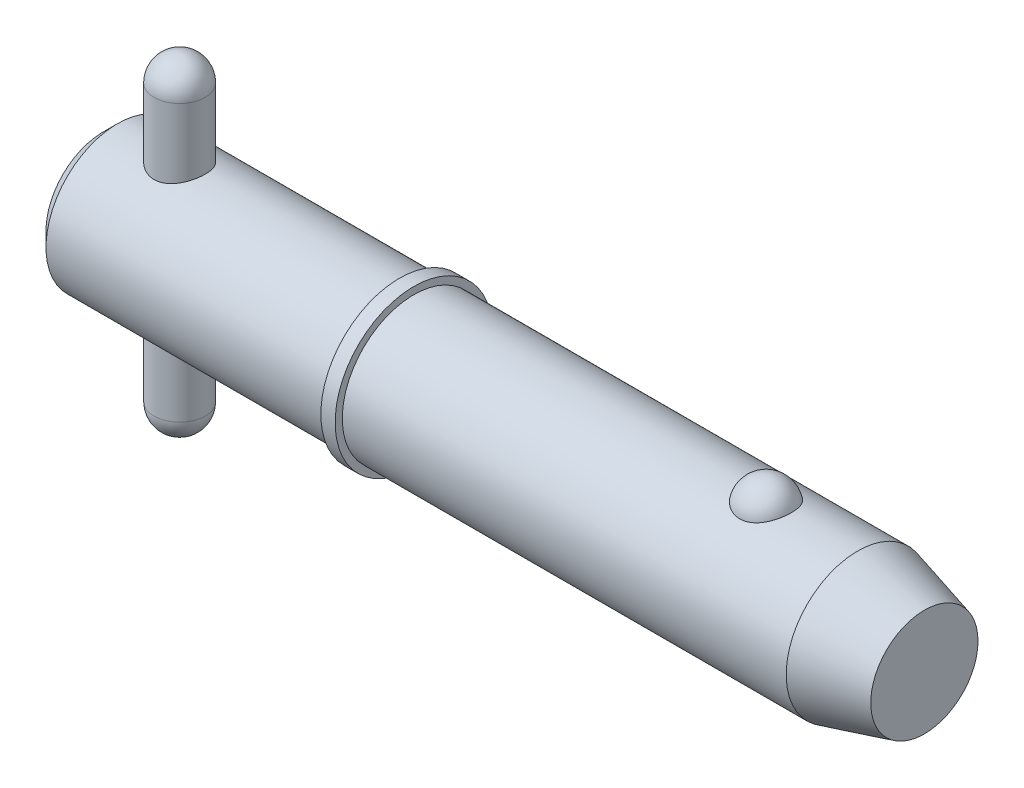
ISO-10303-21;
HEADER;
FILE_DESCRIPTION(('STEP AP214'),'2;1');
FILE_NAME('part.step','',(''),(''),'','','');
FILE_SCHEMA(('AUTOMOTIVE_DESIGN { 1 0 10303 214 1 1 1 1 }'));
ENDSEC;
DATA;
#1=APPLICATION_CONTEXT('core data for automotive mechanical design processes');
#2=APPLICATION_PROTOCOL_DEFINITION('international standard','automotive_design',2000,#1);
#3=PRODUCT_CONTEXT('',#1,'mechanical');
#4=PRODUCT('Part','Part','',(#3));
#5=PRODUCT_RELATED_PRODUCT_CATEGORY('part','',(#4));
#6=PRODUCT_DEFINITION_FORMATION('','',#4);
#7=PRODUCT_DEFINITION_CONTEXT('part definition',#1,'design');
#8=PRODUCT_DEFINITION('design','',#6,#7);
#9=PRODUCT_DEFINITION_SHAPE('','',#8);
#10=(LENGTH_UNIT() NAMED_UNIT(*) SI_UNIT(.MILLI.,.METRE.));
#11=(NAMED_UNIT(*) PLANE_ANGLE_UNIT() SI_UNIT($,.RADIAN.));
#12=(NAMED_UNIT(*) SI_UNIT($,.STERADIAN.) SOLID_ANGLE_UNIT());
#13=UNCERTAINTY_MEASURE_WITH_UNIT(LENGTH_MEASURE(1.E-05),#10,'distance_accuracy_value','');
#14=(GEOMETRIC_REPRESENTATION_CONTEXT(3) GLOBAL_UNCERTAINTY_ASSIGNED_CONTEXT((#13)) GLOBAL_UNIT_ASSIGNED_CONTEXT((#10,
#11,#12)) REPRESENTATION_CONTEXT('',''));
#15=CARTESIAN_POINT('',(0.,0.,0.));
#16=DIRECTION('',(0.,0.,1.));
#17=DIRECTION('',(1.,0.,0.));
#18=AXIS2_PLACEMENT_3D('',#15,#16,#17);
#19=CARTESIAN_POINT('',(5.94,12.7,0.));
#20=DIRECTION('',(0.,-1.,0.));
#21=DIRECTION('',(0.,0.,-1.));
#22=AXIS2_PLACEMENT_3D('',#19,#20,#21);
#23=CYLINDRICAL_SURFACE('',#22,1.98);
#24=CARTESIAN_POINT('',(5.94,-10.72,0.));
#25=DIRECTION('',(0.,-1.,0.));
#26=DIRECTION('',(0.,0.,-1.));
#27=AXIS2_PLACEMENT_3D('',#24,#25,#26);
#28=CIRCLE('',#27,1.98);
#29=CARTESIAN_POINT('',(5.94,-10.72,-1.98));
#30=VERTEX_POINT('',#29);
#31=EDGE_CURVE('P0_E10',#30,#30,#28,.F.);
#32=ORIENTED_EDGE('',*,*,#31,.T.);
#33=EDGE_LOOP('',(#32));
#34=FACE_BOUND('',#33,.T.);
#35=CARTESIAN_POINT('',(5.94,10.72,0.));
#36=DIRECTION('',(0.,-1.,0.));
#37=DIRECTION('',(0.,0.,-1.));
#38=AXIS2_PLACEMENT_3D('',#35,#36,#37);
#39=CIRCLE('',#38,1.98);
#40=CARTESIAN_POINT('',(5.94,10.72,-1.98));
#41=VERTEX_POINT('',#40);
#42=EDGE_CURVE('P0_E21',#41,#41,#39,.T.);
#43=ORIENTED_EDGE('',*,*,#42,.T.);
#44=EDGE_LOOP('',(#43));
#45=FACE_BOUND('',#44,.T.);
#46=ADVANCED_FACE('P0_F14',(#34,#45),#23,.T.);
#47=CARTESIAN_POINT('',(5.94,-10.72,0.));
#48=DIRECTION('',(0.,0.,1.));
#49=DIRECTION('',(1.,0.,0.));
#50=AXIS2_PLACEMENT_3D('',#47,#48,#49);
#51=SPHERICAL_SURFACE('',#50,1.98);
#52=CARTESIAN_POINT('',(5.94,-10.72,0.));
#53=DIRECTION('',(0.,-1.,0.));
#54=DIRECTION('',(0.,0.,-1.));
#55=AXIS2_PLACEMENT_3D('',#52,#53,#54);
#56=SPHERICAL_SURFACE('',#55,1.98);
#57=ORIENTED_EDGE('',*,*,#31,.F.);
#58=EDGE_LOOP('',(#57));
#59=FACE_BOUND('',#58,.T.);
#60=ADVANCED_FACE('P0_F29',(#59),#56,.T.);
#61=CARTESIAN_POINT('',(5.94,10.72,0.));
#62=DIRECTION('',(0.,0.,1.));
#63=DIRECTION('',(1.,0.,0.));
#64=AXIS2_PLACEMENT_3D('',#61,#62,#63);
#65=SPHERICAL_SURFACE('',#64,1.98);
#66=CARTESIAN_POINT('',(5.94,10.72,0.));
#67=DIRECTION('',(0.,-1.,0.));
#68=DIRECTION('',(0.,0.,-1.));
#69=AXIS2_PLACEMENT_3D('',#66,#67,#68);
#70=SPHERICAL_SURFACE('',#69,1.98);
#71=ORIENTED_EDGE('',*,*,#42,.F.);
#72=EDGE_LOOP('',(#71));
#73=FACE_BOUND('',#72,.T.);
#74=ADVANCED_FACE('P0_F16',(#73),#70,.T.);
#75=CLOSED_SHELL('',(#46,#60,#74));
#76=MANIFOLD_SOLID_BREP('P0_B1',#75);
#77=CARTESIAN_POINT('',(0.,0.,0.));
#78=DIRECTION('',(1.,0.,0.));
#79=DIRECTION('',(0.,0.,-1.));
#80=AXIS2_PLACEMENT_3D('',#77,#78,#79);
#81=CYLINDRICAL_SURFACE('',#80,5.555);
#82=CARTESIAN_POINT('',(58.6171144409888,0.,0.));
#83=DIRECTION('',(1.,0.,0.));
#84=DIRECTION('',(0.,0.,-1.));
#85=AXIS2_PLACEMENT_3D('',#82,#83,#84);
#86=CIRCLE('',#85,5.555);
#87=CARTESIAN_POINT('',(58.6171144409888,0.,-5.555));
#88=VERTEX_POINT('',#87);
#89=EDGE_CURVE('P1_E81',#88,#88,#86,.T.);
#90=ORIENTED_EDGE('',*,*,#89,.F.);
#91=EDGE_LOOP('',(#90));
#92=FACE_BOUND('',#91,.T.);
#93=CARTESIAN_POINT('',(24.13,0.,0.));
#94=DIRECTION('',(1.,0.,0.));
#95=DIRECTION('',(0.,0.,-1.));
#96=AXIS2_PLACEMENT_3D('',#93,#94,#95);
#97=CIRCLE('',#96,5.555);
#98=CARTESIAN_POINT('',(24.13,0.,-5.555));
#99=VERTEX_POINT('',#98);
#100=EDGE_CURVE('P1_E85',#99,#99,#97,.T.);
#101=ORIENTED_EDGE('',*,*,#100,.T.);
#102=EDGE_LOOP('',(#101));
#103=FACE_BOUND('',#102,.T.);
#104=CARTESIAN_POINT('',(51.4986264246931,5.16741224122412,2.03859650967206));
#105=CARTESIAN_POINT('',(51.3929492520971,5.16740893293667,2.03859990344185));
#106=CARTESIAN_POINT('',(51.28729894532,5.17079470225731,2.03008306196));
#107=CARTESIAN_POINT('',(51.0791419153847,5.18392795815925,1.99630721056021));
#108=CARTESIAN_POINT('',(50.9766344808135,5.19367399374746,1.97105201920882));
#109=CARTESIAN_POINT('',(50.7777710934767,5.21839168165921,1.90463997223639));
#110=CARTESIAN_POINT('',(50.6814064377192,5.23335573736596,1.86350622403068));
#111=CARTESIAN_POINT('',(50.4970804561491,5.26688076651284,1.76652592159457));
#112=CARTESIAN_POINT('',(50.4091207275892,5.28544242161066,1.71067657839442));
#113=CARTESIAN_POINT('',(50.2412654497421,5.32479845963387,1.58399959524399));
#114=CARTESIAN_POINT('',(50.1616656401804,5.34564089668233,1.51279545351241));
#115=CARTESIAN_POINT('',(50.0151290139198,5.38697258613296,1.35828584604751));
#116=CARTESIAN_POINT('',(49.948194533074,5.40746177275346,1.27497815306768));
#117=CARTESIAN_POINT('',(49.8256103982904,5.44694508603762,1.09440293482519));
#118=CARTESIAN_POINT('',(49.7705989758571,5.46583143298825,0.996677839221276));
#119=CARTESIAN_POINT('',(49.6769376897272,5.49908030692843,0.792961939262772));
#120=CARTESIAN_POINT('',(49.6382894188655,5.513442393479,0.686970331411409));
#121=CARTESIAN_POINT('',(49.5776807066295,5.53635851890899,0.46801974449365));
#122=CARTESIAN_POINT('',(49.5559725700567,5.54482455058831,0.3549815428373));
#123=CARTESIAN_POINT('',(49.5306362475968,5.55473324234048,0.126595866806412));
#124=CARTESIAN_POINT('',(49.5270077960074,5.55617600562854,0.0112484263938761));
#125=CARTESIAN_POINT('',(49.5378817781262,5.55189984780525,-0.218011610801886));
#126=CARTESIAN_POINT('',(49.5523151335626,5.54620821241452,-0.331928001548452));
#127=CARTESIAN_POINT('',(49.598903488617,5.52828920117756,-0.555544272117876));
#128=CARTESIAN_POINT('',(49.6310588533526,5.5160616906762,-0.665244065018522));
#129=CARTESIAN_POINT('',(49.7124883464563,5.48630779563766,-0.877469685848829));
#130=CARTESIAN_POINT('',(49.7617816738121,5.4687754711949,-0.979987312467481));
#131=CARTESIAN_POINT('',(49.8764785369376,5.43024700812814,-1.1748697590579));
#132=CARTESIAN_POINT('',(49.9418831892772,5.4092506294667,-1.26723387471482));
#133=CARTESIAN_POINT('',(50.0875712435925,5.36600927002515,-1.4394013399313));
#134=CARTESIAN_POINT('',(50.1678859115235,5.34376173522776,-1.51917763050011));
#135=CARTESIAN_POINT('',(50.3414520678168,5.30057971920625,-1.66360338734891));
#136=CARTESIAN_POINT('',(50.434702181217,5.27964509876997,-1.72825445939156));
#137=CARTESIAN_POINT('',(50.6293939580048,5.24205250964,-1.83909478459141));
#138=CARTESIAN_POINT('',(50.7305900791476,5.22530519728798,-1.88568407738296));
#139=CARTESIAN_POINT('',(50.9401552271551,5.1975091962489,-1.96100802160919));
#140=CARTESIAN_POINT('',(51.0485215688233,5.1864583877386,-1.98974931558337));
#141=CARTESIAN_POINT('',(51.2634989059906,5.17184410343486,-2.02742262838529));
#142=CARTESIAN_POINT('',(51.369925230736,5.1679328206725,-2.03727608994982));
#143=CARTESIAN_POINT('',(51.5829925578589,5.16698995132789,-2.03966777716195));
#144=CARTESIAN_POINT('',(51.6896335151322,5.16995704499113,-2.03220932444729));
#145=CARTESIAN_POINT('',(51.8967730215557,5.18222383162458,-2.00071170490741));
#146=CARTESIAN_POINT('',(51.9973599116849,5.19133213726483,-1.97717337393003));
#147=CARTESIAN_POINT('',(52.1930141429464,5.21467637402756,-1.91475248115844));
#148=CARTESIAN_POINT('',(52.2880810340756,5.22891272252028,-1.8758686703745));
#149=CARTESIAN_POINT('',(52.4723711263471,5.26137066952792,-1.7828271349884));
#150=CARTESIAN_POINT('',(52.5614190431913,5.27967329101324,-1.72835124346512));
#151=CARTESIAN_POINT('',(52.7292880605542,5.3181741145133,-1.60597483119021));
#152=CARTESIAN_POINT('',(52.8081068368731,5.33837274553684,-1.53807126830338));
#153=CARTESIAN_POINT('',(52.9575156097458,5.37968287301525,-1.38688970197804));
#154=CARTESIAN_POINT('',(53.0275058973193,5.40079011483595,-1.30301744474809));
#155=CARTESIAN_POINT('',(53.1530125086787,5.44074401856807,-1.12458170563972));
#156=CARTESIAN_POINT('',(53.2085262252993,5.4595902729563,-1.03001630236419));
#157=CARTESIAN_POINT('',(53.3055507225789,5.49369849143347,-0.829439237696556));
#158=CARTESIAN_POINT('',(53.3465483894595,5.50882422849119,-0.723155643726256));
#159=CARTESIAN_POINT('',(53.4111250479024,5.53310911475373,-0.50477271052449));
#160=CARTESIAN_POINT('',(53.4347036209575,5.54226812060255,-0.392673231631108));
#161=CARTESIAN_POINT('',(53.464013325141,5.55370358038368,-0.165459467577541));
#162=CARTESIAN_POINT('',(53.4696884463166,5.55595843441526,-0.0503368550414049));
#163=CARTESIAN_POINT('',(53.462916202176,5.55329317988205,0.179288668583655));
#164=CARTESIAN_POINT('',(53.4504690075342,5.54837313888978,0.293791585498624));
#165=CARTESIAN_POINT('',(53.4077798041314,5.53189037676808,0.518526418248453));
#166=CARTESIAN_POINT('',(53.377598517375,5.5203503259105,0.62877154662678));
#167=CARTESIAN_POINT('',(53.3000962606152,5.49182453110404,0.84231815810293));
#168=CARTESIAN_POINT('',(53.2527743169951,5.47483847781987,0.945619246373));
#169=CARTESIAN_POINT('',(53.1417204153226,5.43710633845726,1.14281571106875));
#170=CARTESIAN_POINT('',(53.077921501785,5.41634501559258,1.23667048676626));
#171=CARTESIAN_POINT('',(52.9353577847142,5.37334572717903,1.41185243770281));
#172=CARTESIAN_POINT('',(52.8565932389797,5.35110778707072,1.49317982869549));
#173=CARTESIAN_POINT('',(52.6864234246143,5.30779474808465,1.64049162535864));
#174=CARTESIAN_POINT('',(52.5951002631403,5.28671324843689,1.70656877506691));
#175=CARTESIAN_POINT('',(52.4017390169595,5.24804852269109,1.82201372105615));
#176=CARTESIAN_POINT('',(52.2997005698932,5.23046541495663,1.87138095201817));
#177=CARTESIAN_POINT('',(52.0836187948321,5.20042692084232,1.95335298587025));
#178=CARTESIAN_POINT('',(51.9692602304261,5.18820192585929,1.98521734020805));
#179=CARTESIAN_POINT('',(51.7361307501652,5.17169804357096,2.02783294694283));
#180=CARTESIAN_POINT('',(51.6173616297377,5.16741595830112,2.03859269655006));
#181=CARTESIAN_POINT('',(51.4986264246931,5.16741224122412,2.03859650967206));
#182=B_SPLINE_CURVE_WITH_KNOTS('',3,(#104,#105,#106,#107,#108,#109,#110,#111,#112,#113,#114,
#115,#116,#117,#118,#119,#120,#121,#122,#123,#124,#125,#126,#127,#128,#129,#130,#131,#132,#133,
#134,#135,#136,#137,#138,#139,#140,#141,#142,#143,#144,#145,#146,#147,#148,#149,#150,#151,#152,
#153,#154,#155,#156,#157,#158,#159,#160,#161,#162,#163,#164,#165,#166,#167,#168,#169,#170,#171,
#172,#173,#174,#175,#176,#177,#178,#179,#180,#181),.UNSPECIFIED.,.T.,.F.,(4,2,2,2,2,2,2,2,2,2,2,
2,2,2,2,2,2,2,2,2,2,2,2,2,2,2,2,2,2,2,2,2,2,2,2,2,2,2,4),(0.,0.316595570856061,
0.633118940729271,0.949183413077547,1.26530783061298,1.59030762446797,1.9153672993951,
2.25495824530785,2.59458224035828,2.93917283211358,3.28375835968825,3.62703002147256,
3.97030875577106,4.31397329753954,4.657661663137,5.00207904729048,5.34645984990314,
5.68270547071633,6.01882587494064,6.33808403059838,6.65728093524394,6.96696376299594,
7.27667180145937,7.59321535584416,7.90983070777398,8.24210387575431,8.57443684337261,
8.91755896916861,9.2606893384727,9.60489211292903,9.94909164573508,10.2921194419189,
10.6351667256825,10.9796305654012,11.3240884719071,11.6663928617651,12.0087088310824,
12.3645679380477,12.7202837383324),.UNSPECIFIED.);
#183=CARTESIAN_POINT('',(51.4986264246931,5.16741224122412,2.03859650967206));
#184=VERTEX_POINT('',#183);
#185=EDGE_CURVE('P1_E35',#184,#184,#182,.T.);
#186=ORIENTED_EDGE('',*,*,#185,.T.);
#187=EDGE_LOOP('',(#186));
#188=FACE_BOUND('',#187,.T.);
#189=ADVANCED_FACE('P1_F13',(#92,#103,#188),#81,.T.);
#190=CARTESIAN_POINT('',(0.,0.,0.));
#191=DIRECTION('',(-1.,0.,0.));
#192=DIRECTION('',(0.,0.,1.));
#193=AXIS2_PLACEMENT_3D('',#190,#191,#192);
#194=PLANE('',#193);
#195=CARTESIAN_POINT('',(0.,0.,0.));
#196=DIRECTION('',(1.,0.,0.));
#197=DIRECTION('',(0.,0.,-1.));
#198=AXIS2_PLACEMENT_3D('',#195,#196,#197);
#199=CIRCLE('',#198,4.444);
#200=CARTESIAN_POINT('',(0.,0.,-4.444));
#201=VERTEX_POINT('',#200);
#202=EDGE_CURVE('P1_E9',#201,#201,#199,.T.);
#203=ORIENTED_EDGE('',*,*,#202,.F.);
#204=EDGE_LOOP('',(#203));
#205=FACE_BOUND('',#204,.T.);
#206=ADVANCED_FACE('P1_F15',(#205),#194,.T.);
#207=CARTESIAN_POINT('',(1.111,0.,0.));
#208=DIRECTION('',(1.,0.,0.));
#209=DIRECTION('',(0.,0.,-1.));
#210=AXIS2_PLACEMENT_3D('',#207,#208,#209);
#211=CONICAL_SURFACE('',#210,5.555,0.78539816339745);
#212=ORIENTED_EDGE('',*,*,#202,.T.);
#213=EDGE_LOOP('',(#212));
#214=FACE_BOUND('',#213,.T.);
#215=CARTESIAN_POINT('',(1.111,0.,0.));
#216=DIRECTION('',(1.,0.,0.));
#217=DIRECTION('',(0.,0.,-1.));
#218=AXIS2_PLACEMENT_3D('',#215,#216,#217);
#219=CIRCLE('',#218,5.555);
#220=CARTESIAN_POINT('',(1.111,0.,-5.555));
#221=VERTEX_POINT('',#220);
#222=EDGE_CURVE('P1_E26',#221,#221,#219,.T.);
#223=ORIENTED_EDGE('',*,*,#222,.F.);
#224=EDGE_LOOP('',(#223));
#225=FACE_BOUND('',#224,.T.);
#226=ADVANCED_FACE('P1_F77',(#214,#225),#211,.T.);
#227=CARTESIAN_POINT('',(0.,0.,0.));
#228=DIRECTION('',(1.,0.,0.));
#229=DIRECTION('',(0.,0.,-1.));
#230=AXIS2_PLACEMENT_3D('',#227,#228,#229);
#231=CYLINDRICAL_SURFACE('',#230,5.555);
#232=CARTESIAN_POINT('',(5.94,-5.19014691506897,1.98));
#233=CARTESIAN_POINT('',(5.83264687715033,-5.19014494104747,1.98000226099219));
#234=CARTESIAN_POINT('',(5.7253094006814,-5.19351395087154,1.97123988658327));
#235=CARTESIAN_POINT('',(5.51384517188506,-5.20654291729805,1.93656219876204));
#236=CARTESIAN_POINT('',(5.40971858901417,-5.21620320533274,1.91064598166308));
#237=CARTESIAN_POINT('',(5.20778082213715,-5.24058443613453,1.84271148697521));
#238=CARTESIAN_POINT('',(5.10995634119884,-5.25529427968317,1.80072850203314));
#239=CARTESIAN_POINT('',(4.92270352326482,-5.28810012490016,1.70197537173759));
#240=CARTESIAN_POINT('',(4.83327743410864,-5.3061970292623,1.64520128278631));
#241=CARTESIAN_POINT('',(4.66135184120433,-5.34464714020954,1.51575187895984));
#242=CARTESIAN_POINT('',(4.57928277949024,-5.36506222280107,1.44252311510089));
#243=CARTESIAN_POINT('',(4.42829115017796,-5.40532920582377,1.28342047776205));
#244=CARTESIAN_POINT('',(4.35937105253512,-5.42518099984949,1.19754423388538));
#245=CARTESIAN_POINT('',(4.23461605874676,-5.46281133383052,1.01237205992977));
#246=CARTESIAN_POINT('',(4.17924129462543,-5.48050875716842,0.912748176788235));
#247=CARTESIAN_POINT('',(4.0862117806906,-5.51109938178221,0.70485824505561));
#248=CARTESIAN_POINT('',(4.0485515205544,-5.52399407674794,0.596594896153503));
#249=CARTESIAN_POINT('',(3.99350662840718,-5.54308759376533,0.379019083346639));
#250=CARTESIAN_POINT('',(3.97538263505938,-5.54952987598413,0.269915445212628));
#251=CARTESIAN_POINT('',(3.95756405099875,-5.55586205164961,0.0500378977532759));
#252=CARTESIAN_POINT('',(3.95786404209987,-5.55575387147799,-0.060735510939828));
#253=CARTESIAN_POINT('',(3.97643665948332,-5.54915684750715,-0.275539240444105));
#254=CARTESIAN_POINT('',(3.99390415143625,-5.54295384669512,-0.379649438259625));
#255=CARTESIAN_POINT('',(4.0449721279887,-5.52523170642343,-0.583350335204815));
#256=CARTESIAN_POINT('',(4.07857373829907,-5.51371219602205,-0.682940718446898));
#257=CARTESIAN_POINT('',(4.16137312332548,-5.4863099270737,-0.876423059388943));
#258=CARTESIAN_POINT('',(4.2107826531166,-5.47036834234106,-0.970215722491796));
#259=CARTESIAN_POINT('',(4.32361427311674,-5.43575653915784,-1.1484017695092));
#260=CARTESIAN_POINT('',(4.38704062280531,-5.41708549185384,-1.23279228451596));
#261=CARTESIAN_POINT('',(4.53006791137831,-5.37778429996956,-1.39454579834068));
#262=CARTESIAN_POINT('',(4.61035105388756,-5.35710277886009,-1.4712940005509));
#263=CARTESIAN_POINT('',(4.78279835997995,-5.31692766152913,-1.6104545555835));
#264=CARTESIAN_POINT('',(4.874964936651,-5.29743430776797,-1.67286398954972));
#265=CARTESIAN_POINT('',(5.07076688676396,-5.26153775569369,-1.78259698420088));
#266=CARTESIAN_POINT('',(5.17458163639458,-5.24519780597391,-1.8296227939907));
#267=CARTESIAN_POINT('',(5.38938990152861,-5.21818744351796,-1.90530278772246));
#268=CARTESIAN_POINT('',(5.50037985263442,-5.20751423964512,-1.93396601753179));
#269=CARTESIAN_POINT('',(5.72036376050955,-5.19369176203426,-1.97077654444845));
#270=CARTESIAN_POINT('',(5.82917370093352,-5.19018851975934,-1.97989015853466));
#271=CARTESIAN_POINT('',(6.04680100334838,-5.19010609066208,-1.98010779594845));
#272=CARTESIAN_POINT('',(6.15561835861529,-5.19352540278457,-1.97121572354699));
#273=CARTESIAN_POINT('',(6.36548036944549,-5.20654623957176,-1.93654727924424));
#274=CARTESIAN_POINT('',(6.46666051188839,-5.21588705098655,-1.91148218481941));
#275=CARTESIAN_POINT('',(6.66334537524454,-5.23939939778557,-1.84605494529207));
#276=CARTESIAN_POINT('',(6.75884899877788,-5.25357186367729,-1.8056898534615));
#277=CARTESIAN_POINT('',(6.94517989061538,-5.28576258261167,-1.70921153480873));
#278=CARTESIAN_POINT('',(7.03572661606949,-5.30389804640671,-1.65259670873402));
#279=CARTESIAN_POINT('',(7.20638087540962,-5.34176077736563,-1.52577523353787));
#280=CARTESIAN_POINT('',(7.28648490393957,-5.36148857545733,-1.45556404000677));
#281=CARTESIAN_POINT('',(7.43864697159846,-5.40165494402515,-1.2988614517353));
#282=CARTESIAN_POINT('',(7.50999887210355,-5.42207106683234,-1.21167640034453));
#283=CARTESIAN_POINT('',(7.63712639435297,-5.46023601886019,-1.026066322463));
#284=CARTESIAN_POINT('',(7.69290228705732,-5.47798489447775,-0.927641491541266));
#285=CARTESIAN_POINT('',(7.78684673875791,-5.50876590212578,-0.722633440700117));
#286=CARTESIAN_POINT('',(7.82510508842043,-5.52182201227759,-0.616095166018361));
#287=CARTESIAN_POINT('',(7.88297051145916,-5.54184206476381,-0.397530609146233));
#288=CARTESIAN_POINT('',(7.90258540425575,-5.5488085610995,-0.285506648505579));
#289=CARTESIAN_POINT('',(7.9218262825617,-5.55564472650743,-0.065566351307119));
#290=CARTESIAN_POINT('',(7.92245987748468,-5.55587212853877,0.0422515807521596));
#291=CARTESIAN_POINT('',(7.90626329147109,-5.55011340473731,0.256387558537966));
#292=CARTESIAN_POINT('',(7.88943488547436,-5.54412791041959,0.362705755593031));
#293=CARTESIAN_POINT('',(7.83948457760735,-5.52676548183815,0.568649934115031));
#294=CARTESIAN_POINT('',(7.8067003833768,-5.51550046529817,0.668367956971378));
#295=CARTESIAN_POINT('',(7.72609369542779,-5.48874437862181,0.860911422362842));
#296=CARTESIAN_POINT('',(7.67826838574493,-5.47325251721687,0.953735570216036));
#297=CARTESIAN_POINT('',(7.56675024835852,-5.43884382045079,1.13391068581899));
#298=CARTESIAN_POINT('',(7.50249968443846,-5.41981485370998,1.22089468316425));
#299=CARTESIAN_POINT('',(7.36086495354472,-5.38069275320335,1.38316665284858));
#300=CARTESIAN_POINT('',(7.28347630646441,-5.36059925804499,1.45845061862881));
#301=CARTESIAN_POINT('',(7.11347587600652,-5.32048380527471,1.59876646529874));
#302=CARTESIAN_POINT('',(7.02032386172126,-5.30050854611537,1.66315951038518));
#303=CARTESIAN_POINT('',(6.82388804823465,-5.26398994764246,1.77536801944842));
#304=CARTESIAN_POINT('',(6.7206049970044,-5.24744635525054,1.82318470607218));
#305=CARTESIAN_POINT('',(6.50639706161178,-5.21987969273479,1.90068230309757));
#306=CARTESIAN_POINT('',(6.3954529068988,-5.20887116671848,1.93031547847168));
#307=CARTESIAN_POINT('',(6.16966522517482,-5.19400760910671,1.96996824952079));
#308=CARTESIAN_POINT('',(6.05482366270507,-5.19014902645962,1.97999758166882));
#309=CARTESIAN_POINT('',(5.94,-5.19014691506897,1.98));
#310=B_SPLINE_CURVE_WITH_KNOTS('',3,(#232,#233,#234,#235,#236,#237,#238,#239,#240,#241,#242,
#243,#244,#245,#246,#247,#248,#249,#250,#251,#252,#253,#254,#255,#256,#257,#258,#259,#260,#261,
#262,#263,#264,#265,#266,#267,#268,#269,#270,#271,#272,#273,#274,#275,#276,#277,#278,#279,#280,
#281,#282,#283,#284,#285,#286,#287,#288,#289,#290,#291,#292,#293,#294,#295,#296,#297,#298,#299,
#300,#301,#302,#303,#304,#305,#306,#307,#308,#309),.UNSPECIFIED.,.T.,.F.,(4,2,2,2,2,2,2,2,2,2,2,
2,2,2,2,2,2,2,2,2,2,2,2,2,2,2,2,2,2,2,2,2,2,2,2,2,2,2,4),(0.,0.321632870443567,
0.643282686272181,0.964229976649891,1.28526292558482,1.61937087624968,1.9535415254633,
2.29784481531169,2.64204093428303,2.97269632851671,3.30325448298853,3.61901541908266,
3.93479838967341,4.25500220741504,4.57530346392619,4.91268648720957,5.25013812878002,
5.59378026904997,5.93725299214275,6.26331481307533,6.58930593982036,6.90185604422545,
7.21446637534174,7.53801472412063,7.86167140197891,8.20353561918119,8.54539388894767,
8.88547970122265,9.22542281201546,9.54728637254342,9.86911722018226,10.1844146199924,
10.4997710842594,10.827730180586,11.1558013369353,11.499115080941,11.8424034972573,
12.1865892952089,12.5306041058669),.UNSPECIFIED.);
#311=CARTESIAN_POINT('',(5.94,-5.19014691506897,1.98));
#312=VERTEX_POINT('',#311);
#313=EDGE_CURVE('P1_E17',#312,#312,#310,.T.);
#314=ORIENTED_EDGE('',*,*,#313,.F.);
#315=EDGE_LOOP('',(#314));
#316=FACE_BOUND('',#315,.T.);
#317=CARTESIAN_POINT('',(5.94,5.19014691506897,1.98));
#318=CARTESIAN_POINT('',(6.04735312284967,5.19014494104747,1.98000226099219));
#319=CARTESIAN_POINT('',(6.1546905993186,5.19351395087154,1.97123988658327));
#320=CARTESIAN_POINT('',(6.36615482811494,5.20654291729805,1.93656219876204));
#321=CARTESIAN_POINT('',(6.47028141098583,5.21620320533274,1.91064598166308));
#322=CARTESIAN_POINT('',(6.67221917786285,5.24058443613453,1.84271148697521));
#323=CARTESIAN_POINT('',(6.77004365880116,5.25529427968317,1.80072850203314));
#324=CARTESIAN_POINT('',(6.95729647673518,5.28810012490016,1.70197537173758));
#325=CARTESIAN_POINT('',(7.04672256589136,5.3061970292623,1.64520128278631));
#326=CARTESIAN_POINT('',(7.21864815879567,5.34464714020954,1.51575187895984));
#327=CARTESIAN_POINT('',(7.30071722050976,5.36506222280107,1.44252311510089));
#328=CARTESIAN_POINT('',(7.45170884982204,5.40532920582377,1.28342047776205));
#329=CARTESIAN_POINT('',(7.52062894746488,5.42518099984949,1.19754423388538));
#330=CARTESIAN_POINT('',(7.64538394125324,5.46281133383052,1.01237205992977));
#331=CARTESIAN_POINT('',(7.70075870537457,5.48050875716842,0.912748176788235));
#332=CARTESIAN_POINT('',(7.7937882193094,5.51109938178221,0.704858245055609));
#333=CARTESIAN_POINT('',(7.8314484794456,5.52399407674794,0.596594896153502));
#334=CARTESIAN_POINT('',(7.88649337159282,5.54308759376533,0.379019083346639));
#335=CARTESIAN_POINT('',(7.90461736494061,5.54952987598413,0.269915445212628));
#336=CARTESIAN_POINT('',(7.92243594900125,5.55586205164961,0.0500378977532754));
#337=CARTESIAN_POINT('',(7.92213595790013,5.55575387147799,-0.0607355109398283));
#338=CARTESIAN_POINT('',(7.90356334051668,5.54915684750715,-0.275539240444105));
#339=CARTESIAN_POINT('',(7.88609584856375,5.54295384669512,-0.379649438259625));
#340=CARTESIAN_POINT('',(7.8350278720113,5.52523170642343,-0.583350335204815));
#341=CARTESIAN_POINT('',(7.80142626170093,5.51371219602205,-0.682940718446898));
#342=CARTESIAN_POINT('',(7.71862687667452,5.4863099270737,-0.876423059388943));
#343=CARTESIAN_POINT('',(7.6692173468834,5.47036834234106,-0.970215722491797));
#344=CARTESIAN_POINT('',(7.55638572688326,5.43575653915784,-1.1484017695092));
#345=CARTESIAN_POINT('',(7.49295937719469,5.41708549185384,-1.23279228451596));
#346=CARTESIAN_POINT('',(7.34993208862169,5.37778429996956,-1.39454579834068));
#347=CARTESIAN_POINT('',(7.26964894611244,5.35710277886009,-1.4712940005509));
#348=CARTESIAN_POINT('',(7.09720164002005,5.31692766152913,-1.6104545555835));
#349=CARTESIAN_POINT('',(7.00503506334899,5.29743430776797,-1.67286398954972));
#350=CARTESIAN_POINT('',(6.80923311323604,5.26153775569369,-1.78259698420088));
#351=CARTESIAN_POINT('',(6.70541836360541,5.24519780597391,-1.8296227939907));
#352=CARTESIAN_POINT('',(6.49061009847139,5.21818744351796,-1.90530278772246));
#353=CARTESIAN_POINT('',(6.37962014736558,5.20751423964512,-1.93396601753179));
#354=CARTESIAN_POINT('',(6.15963623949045,5.19369176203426,-1.97077654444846));
#355=CARTESIAN_POINT('',(6.05082629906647,5.19018851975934,-1.97989015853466));
#356=CARTESIAN_POINT('',(5.83319899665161,5.19010609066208,-1.98010779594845));
#357=CARTESIAN_POINT('',(5.7243816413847,5.19352540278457,-1.97121572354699));
#358=CARTESIAN_POINT('',(5.5145196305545,5.20654623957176,-1.93654727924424));
#359=CARTESIAN_POINT('',(5.4133394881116,5.21588705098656,-1.91148218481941));
#360=CARTESIAN_POINT('',(5.21665462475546,5.23939939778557,-1.84605494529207));
#361=CARTESIAN_POINT('',(5.12115100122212,5.25357186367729,-1.8056898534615));
#362=CARTESIAN_POINT('',(4.93482010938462,5.28576258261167,-1.70921153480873));
#363=CARTESIAN_POINT('',(4.84427338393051,5.30389804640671,-1.65259670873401));
#364=CARTESIAN_POINT('',(4.67361912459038,5.34176077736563,-1.52577523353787));
#365=CARTESIAN_POINT('',(4.59351509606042,5.36148857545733,-1.45556404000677));
#366=CARTESIAN_POINT('',(4.44135302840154,5.40165494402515,-1.2988614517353));
#367=CARTESIAN_POINT('',(4.37000112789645,5.42207106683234,-1.21167640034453));
#368=CARTESIAN_POINT('',(4.24287360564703,5.46023601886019,-1.026066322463));
#369=CARTESIAN_POINT('',(4.18709771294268,5.47798489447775,-0.927641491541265));
#370=CARTESIAN_POINT('',(4.09315326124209,5.50876590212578,-0.722633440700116));
#371=CARTESIAN_POINT('',(4.05489491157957,5.52182201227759,-0.61609516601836));
#372=CARTESIAN_POINT('',(3.99702948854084,5.54184206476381,-0.397530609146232));
#373=CARTESIAN_POINT('',(3.97741459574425,5.5488085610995,-0.285506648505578));
#374=CARTESIAN_POINT('',(3.9581737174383,5.55564472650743,-0.0655663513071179));
#375=CARTESIAN_POINT('',(3.95754012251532,5.55587212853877,0.0422515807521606));
#376=CARTESIAN_POINT('',(3.97373670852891,5.55011340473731,0.256387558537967));
#377=CARTESIAN_POINT('',(3.99056511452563,5.54412791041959,0.362705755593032));
#378=CARTESIAN_POINT('',(4.04051542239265,5.52676548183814,0.568649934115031));
#379=CARTESIAN_POINT('',(4.07329961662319,5.51550046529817,0.668367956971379));
#380=CARTESIAN_POINT('',(4.15390630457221,5.48874437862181,0.860911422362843));
#381=CARTESIAN_POINT('',(4.20173161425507,5.47325251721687,0.953735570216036));
#382=CARTESIAN_POINT('',(4.31324975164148,5.43884382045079,1.13391068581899));
#383=CARTESIAN_POINT('',(4.37750031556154,5.41981485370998,1.22089468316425));
#384=CARTESIAN_POINT('',(4.51913504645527,5.38069275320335,1.38316665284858));
#385=CARTESIAN_POINT('',(4.59652369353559,5.36059925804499,1.45845061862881));
#386=CARTESIAN_POINT('',(4.76652412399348,5.32048380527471,1.59876646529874));
#387=CARTESIAN_POINT('',(4.85967613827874,5.30050854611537,1.66315951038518));
#388=CARTESIAN_POINT('',(5.05611195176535,5.26398994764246,1.77536801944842));
#389=CARTESIAN_POINT('',(5.1593950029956,5.24744635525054,1.82318470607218));
#390=CARTESIAN_POINT('',(5.37360293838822,5.21987969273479,1.90068230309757));
#391=CARTESIAN_POINT('',(5.4845470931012,5.20887116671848,1.93031547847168));
#392=CARTESIAN_POINT('',(5.71033477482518,5.19400760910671,1.96996824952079));
#393=CARTESIAN_POINT('',(5.82517633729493,5.19014902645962,1.97999758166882));
#394=CARTESIAN_POINT('',(5.94,5.19014691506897,1.98));
#395=B_SPLINE_CURVE_WITH_KNOTS('',3,(#317,#318,#319,#320,#321,#322,#323,#324,#325,#326,#327,
#328,#329,#330,#331,#332,#333,#334,#335,#336,#337,#338,#339,#340,#341,#342,#343,#344,#345,#346,
#347,#348,#349,#350,#351,#352,#353,#354,#355,#356,#357,#358,#359,#360,#361,#362,#363,#364,#365,
#366,#367,#368,#369,#370,#371,#372,#373,#374,#375,#376,#377,#378,#379,#380,#381,#382,#383,#384,
#385,#386,#387,#388,#389,#390,#391,#392,#393,#394),.UNSPECIFIED.,.T.,.F.,(4,2,2,2,2,2,2,2,2,2,2,
2,2,2,2,2,2,2,2,2,2,2,2,2,2,2,2,2,2,2,2,2,2,2,2,2,2,2,4),(0.,0.321632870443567,
0.643282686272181,0.964229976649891,1.28526292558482,1.61937087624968,1.9535415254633,
2.29784481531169,2.64204093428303,2.97269632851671,3.30325448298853,3.61901541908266,
3.93479838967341,4.25500220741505,4.57530346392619,4.91268648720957,5.25013812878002,
5.59378026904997,5.93725299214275,6.26331481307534,6.58930593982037,6.90185604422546,
7.21446637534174,7.53801472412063,7.86167140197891,8.20353561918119,8.54539388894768,
8.88547970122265,9.22542281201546,9.54728637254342,9.86911722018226,10.1844146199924,
10.4997710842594,10.827730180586,11.1558013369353,11.499115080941,11.8424034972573,
12.1865892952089,12.5306041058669),.UNSPECIFIED.);
#396=CARTESIAN_POINT('',(5.94,5.19014691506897,1.98));
#397=VERTEX_POINT('',#396);
#398=EDGE_CURVE('P1_E43',#397,#397,#395,.T.);
#399=ORIENTED_EDGE('',*,*,#398,.F.);
#400=EDGE_LOOP('',(#399));
#401=FACE_BOUND('',#400,.T.);
#402=ORIENTED_EDGE('',*,*,#222,.T.);
#403=EDGE_LOOP('',(#402));
#404=FACE_BOUND('',#403,.T.);
#405=CARTESIAN_POINT('',(23.019,0.,0.));
#406=DIRECTION('',(1.,0.,0.));
#407=DIRECTION('',(0.,0.,-1.));
#408=AXIS2_PLACEMENT_3D('',#405,#406,#407);
#409=CIRCLE('',#408,5.555);
#410=CARTESIAN_POINT('',(23.019,0.,-5.555));
#411=VERTEX_POINT('',#410);
#412=EDGE_CURVE('P1_E31',#411,#411,#409,.T.);
#413=ORIENTED_EDGE('',*,*,#412,.F.);
#414=EDGE_LOOP('',(#413));
#415=FACE_BOUND('',#414,.T.);
#416=ADVANCED_FACE('P1_F103',(#316,#401,#404,#415),#231,.T.);
#417=CARTESIAN_POINT('',(23.019,5.555,0.));
#418=DIRECTION('',(-1.,0.,0.));
#419=DIRECTION('',(0.,0.,1.));
#420=AXIS2_PLACEMENT_3D('',#417,#418,#419);
#421=PLANE('',#420);
#422=ORIENTED_EDGE('',*,*,#412,.T.);
#423=EDGE_LOOP('',(#422));
#424=FACE_BOUND('',#423,.T.);
#425=CARTESIAN_POINT('',(23.019,0.,0.));
#426=DIRECTION('',(1.,0.,0.));
#427=DIRECTION('',(0.,0.,-1.));
#428=AXIS2_PLACEMENT_3D('',#425,#426,#427);
#429=CIRCLE('',#428,6.1105);
#430=CARTESIAN_POINT('',(23.019,0.,-6.1105));
#431=VERTEX_POINT('',#430);
#432=EDGE_CURVE('P1_E91',#431,#431,#429,.T.);
#433=ORIENTED_EDGE('',*,*,#432,.F.);
#434=EDGE_LOOP('',(#433));
#435=FACE_BOUND('',#434,.T.);
#436=ADVANCED_FACE('P1_F100',(#424,#435),#421,.T.);
#437=CARTESIAN_POINT('',(0.,0.,0.));
#438=DIRECTION('',(1.,0.,0.));
#439=DIRECTION('',(0.,0.,-1.));
#440=AXIS2_PLACEMENT_3D('',#437,#438,#439);
#441=CYLINDRICAL_SURFACE('',#440,6.1105);
#442=ORIENTED_EDGE('',*,*,#432,.T.);
#443=EDGE_LOOP('',(#442));
#444=FACE_BOUND('',#443,.T.);
#445=CARTESIAN_POINT('',(24.13,0.,0.));
#446=DIRECTION('',(1.,0.,0.));
#447=DIRECTION('',(0.,0.,-1.));
#448=AXIS2_PLACEMENT_3D('',#445,#446,#447);
#449=CIRCLE('',#448,6.1105);
#450=CARTESIAN_POINT('',(24.13,0.,-6.1105));
#451=VERTEX_POINT('',#450);
#452=EDGE_CURVE('P1_E88',#451,#451,#449,.T.);
#453=ORIENTED_EDGE('',*,*,#452,.F.);
#454=EDGE_LOOP('',(#453));
#455=FACE_BOUND('',#454,.T.);
#456=ADVANCED_FACE('P1_F68',(#444,#455),#441,.T.);
#457=CARTESIAN_POINT('',(24.13,6.1105,0.));
#458=DIRECTION('',(1.,0.,0.));
#459=DIRECTION('',(0.,0.,-1.));
#460=AXIS2_PLACEMENT_3D('',#457,#458,#459);
#461=PLANE('',#460);
#462=ORIENTED_EDGE('',*,*,#452,.T.);
#463=EDGE_LOOP('',(#462));
#464=FACE_BOUND('',#463,.T.);
#465=ORIENTED_EDGE('',*,*,#100,.F.);
#466=EDGE_LOOP('',(#465));
#467=FACE_BOUND('',#466,.T.);
#468=ADVANCED_FACE('P1_F62',(#464,#467),#461,.T.);
#469=CARTESIAN_POINT('',(63.8,0.,0.));
#470=DIRECTION('',(-1.,0.,0.));
#471=DIRECTION('',(0.,0.,1.));
#472=AXIS2_PLACEMENT_3D('',#469,#470,#471);
#473=CONICAL_SURFACE('',#472,4.16625000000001,0.26179938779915);
#474=ORIENTED_EDGE('',*,*,#89,.T.);
#475=EDGE_LOOP('',(#474));
#476=FACE_BOUND('',#475,.T.);
#477=CARTESIAN_POINT('',(63.8,0.,0.));
#478=DIRECTION('',(1.,0.,0.));
#479=DIRECTION('',(0.,0.,-1.));
#480=AXIS2_PLACEMENT_3D('',#477,#478,#479);
#481=CIRCLE('',#480,4.16625000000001);
#482=CARTESIAN_POINT('',(63.8,0.,-4.16625000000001));
#483=VERTEX_POINT('',#482);
#484=EDGE_CURVE('P1_E42',#483,#483,#481,.T.);
#485=ORIENTED_EDGE('',*,*,#484,.F.);
#486=EDGE_LOOP('',(#485));
#487=FACE_BOUND('',#486,.T.);
#488=ADVANCED_FACE('P1_F59',(#476,#487),#473,.T.);
#489=CARTESIAN_POINT('',(63.8,4.16625000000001,0.));
#490=DIRECTION('',(1.,0.,0.));
#491=DIRECTION('',(0.,0.,-1.));
#492=AXIS2_PLACEMENT_3D('',#489,#490,#491);
#493=PLANE('',#492);
#494=ORIENTED_EDGE('',*,*,#484,.T.);
#495=EDGE_LOOP('',(#494));
#496=FACE_BOUND('',#495,.T.);
#497=ADVANCED_FACE('P1_F55',(#496),#493,.T.);
#498=CARTESIAN_POINT('',(51.4986264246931,4.9995,0.));
#499=DIRECTION('',(-1.,0.,0.));
#500=DIRECTION('',(0.,1.,0.));
#501=AXIS2_PLACEMENT_3D('',#498,#499,#500);
#502=SPHERICAL_SURFACE('',#501,2.04550000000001);
#503=ORIENTED_EDGE('',*,*,#185,.F.);
#504=EDGE_LOOP('',(#503));
#505=FACE_BOUND('',#504,.T.);
#506=ADVANCED_FACE('P1_F50',(#505),#502,.T.);
#507=CARTESIAN_POINT('',(5.94,-6.1105,0.));
#508=DIRECTION('',(0.,1.,0.));
#509=DIRECTION('',(0.,0.,1.));
#510=AXIS2_PLACEMENT_3D('',#507,#508,#509);
#511=CYLINDRICAL_SURFACE('',#510,1.98);
#512=ORIENTED_EDGE('',*,*,#313,.T.);
#513=EDGE_LOOP('',(#512));
#514=FACE_BOUND('',#513,.T.);
#515=ORIENTED_EDGE('',*,*,#398,.T.);
#516=EDGE_LOOP('',(#515));
#517=FACE_BOUND('',#516,.T.);
#518=ADVANCED_FACE('P1_F54',(#514,#517),#511,.F.);
#519=CLOSED_SHELL('',(#189,#206,#226,#416,#436,#456,#468,#488,#497,#506,#518));
#520=MANIFOLD_SOLID_BREP('P1_B1',#519);
#521=ADVANCED_BREP_SHAPE_REPRESENTATION('',(#18,#76,#520),#14);
#522=SHAPE_DEFINITION_REPRESENTATION(#9,#521);
ENDSEC;
END-ISO-10303-21;
